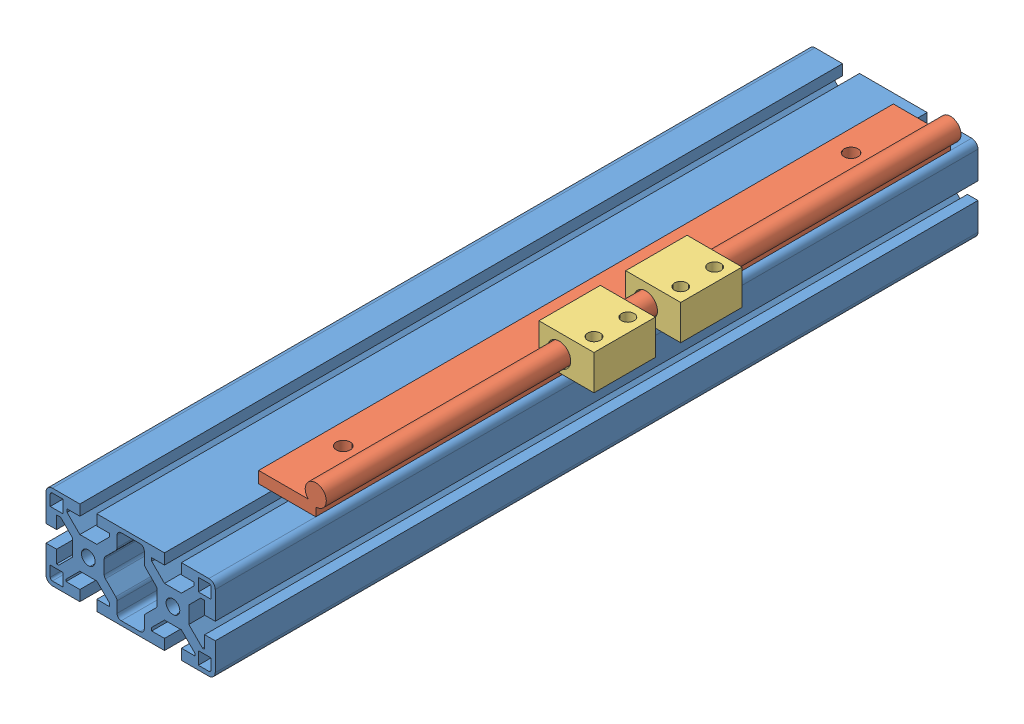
SolidWorks assembly X-Lateral deslizante IZQ.SLDASM, configuration Predeterminado (file format 3800). Lengths in mm.
Overall size (93.5 58 360.5).
5 component instances, 3 part files, 0 mates.
Components (placement in the parent):
- X-Perfil AL estructura 40x80x360-1: X-Perfil AL estructura 40x80x360.SLDPRT [Predeterminado] x (-1 0 0) z (0 0 -1) size (80 40 360.5)
- X-Deslizadera con patin-1: X-Deslizadera con patin.SLDASM [Predeterminado] at (3.5 0 -40.5) x (-1 0 0) z (0 0 -1) size (43.5 18 300)
  - X-Deslizadera simple-1: X-Deslizadera simple.SLDPRT [Predeterminado] at (0 22.75 10) size (32 14 300)
  - X-Patin-1: X-Patin.SLDPRT [Predeterminado] at (-17 29.75 125) size (26 16.5 29)
  - X-Patin-2: X-Patin.SLDPRT [Predeterminado] at (-17 29.75 166) size (26 16.5 29)
